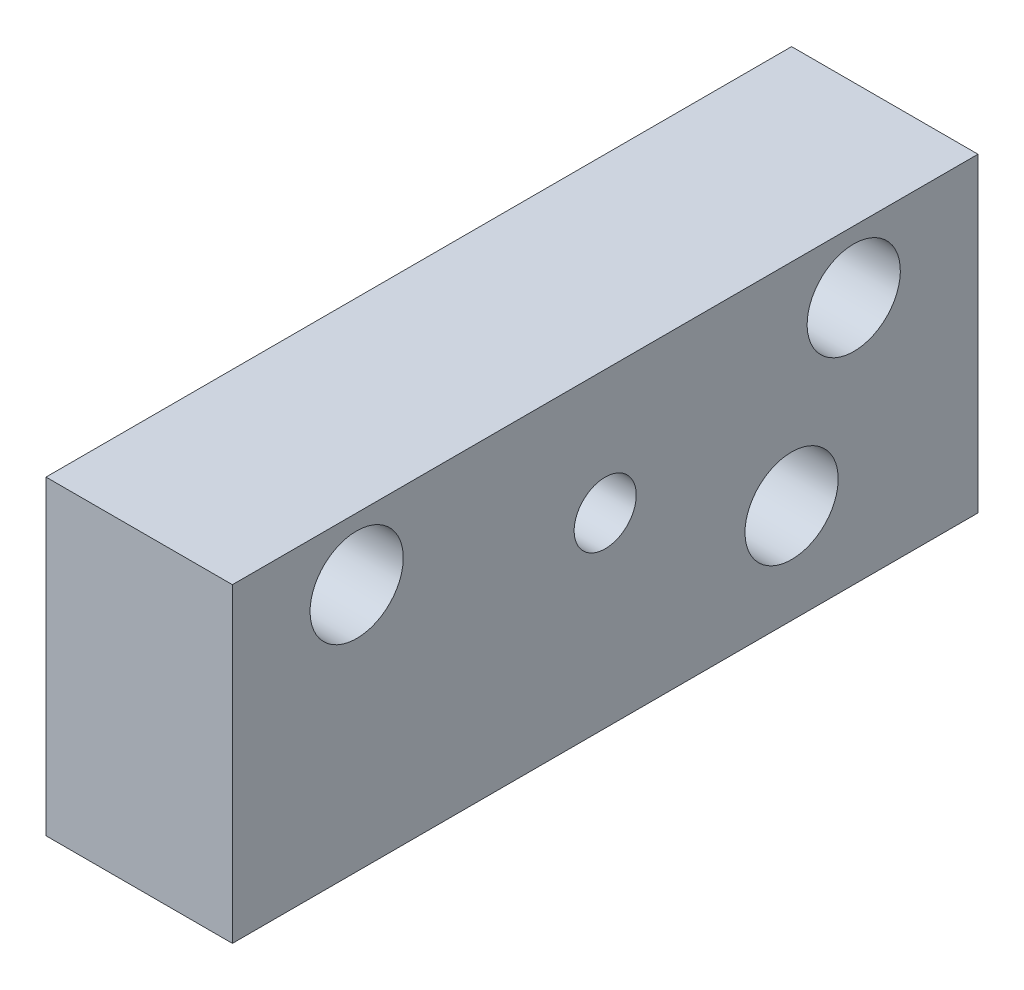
ISO-10303-21;
HEADER;
FILE_DESCRIPTION(('STEP AP214'),'2;1');
FILE_NAME('part.step','',(''),(''),'','','');
FILE_SCHEMA(('AUTOMOTIVE_DESIGN { 1 0 10303 214 1 1 1 1 }'));
ENDSEC;
DATA;
#1=APPLICATION_CONTEXT('core data for automotive mechanical design processes');
#2=APPLICATION_PROTOCOL_DEFINITION('international standard','automotive_design',2000,#1);
#3=PRODUCT_CONTEXT('',#1,'mechanical');
#4=PRODUCT('Part','Part','',(#3));
#5=PRODUCT_RELATED_PRODUCT_CATEGORY('part','',(#4));
#6=PRODUCT_DEFINITION_FORMATION('','',#4);
#7=PRODUCT_DEFINITION_CONTEXT('part definition',#1,'design');
#8=PRODUCT_DEFINITION('design','',#6,#7);
#9=PRODUCT_DEFINITION_SHAPE('','',#8);
#10=(LENGTH_UNIT() NAMED_UNIT(*) SI_UNIT(.MILLI.,.METRE.));
#11=(NAMED_UNIT(*) PLANE_ANGLE_UNIT() SI_UNIT($,.RADIAN.));
#12=(NAMED_UNIT(*) SI_UNIT($,.STERADIAN.) SOLID_ANGLE_UNIT());
#13=UNCERTAINTY_MEASURE_WITH_UNIT(LENGTH_MEASURE(1.E-05),#10,'distance_accuracy_value','');
#14=(GEOMETRIC_REPRESENTATION_CONTEXT(3) GLOBAL_UNCERTAINTY_ASSIGNED_CONTEXT((#13)) GLOBAL_UNIT_ASSIGNED_CONTEXT((#10,
#11,#12)) REPRESENTATION_CONTEXT('',''));
#15=CARTESIAN_POINT('',(0.,0.,0.));
#16=DIRECTION('',(0.,0.,1.));
#17=DIRECTION('',(1.,0.,0.));
#18=AXIS2_PLACEMENT_3D('',#15,#16,#17);
#19=CARTESIAN_POINT('',(47.625,0.,76.2));
#20=DIRECTION('',(0.,1.,0.));
#21=DIRECTION('',(-1.,0.,0.));
#22=AXIS2_PLACEMENT_3D('',#19,#20,#21);
#23=PLANE('',#22);
#24=DIRECTION('',(1.,0.,0.));
#25=VECTOR('',#24,1.);
#26=CARTESIAN_POINT('',(47.625,0.,0.));
#27=LINE('',#26,#25);
#28=CARTESIAN_POINT('',(28.575,0.,0.));
#29=VERTEX_POINT('',#28);
#30=CARTESIAN_POINT('',(47.625,0.,0.));
#31=VERTEX_POINT('',#30);
#32=EDGE_CURVE('E105',#29,#31,#27,.T.);
#33=ORIENTED_EDGE('',*,*,#32,.T.);
#34=DIRECTION('',(0.,0.,-1.));
#35=VECTOR('',#34,1.);
#36=CARTESIAN_POINT('',(47.625,0.,76.2));
#37=LINE('',#36,#35);
#38=CARTESIAN_POINT('',(47.625,0.,76.2));
#39=VERTEX_POINT('',#38);
#40=EDGE_CURVE('E50',#39,#31,#37,.T.);
#41=ORIENTED_EDGE('',*,*,#40,.F.);
#42=DIRECTION('',(1.,0.,0.));
#43=VECTOR('',#42,1.);
#44=CARTESIAN_POINT('',(47.625,0.,76.2));
#45=LINE('',#44,#43);
#46=CARTESIAN_POINT('',(28.575,0.,76.2));
#47=VERTEX_POINT('',#46);
#48=EDGE_CURVE('E97',#47,#39,#45,.T.);
#49=ORIENTED_EDGE('',*,*,#48,.F.);
#50=DIRECTION('',(0.,0.,-1.));
#51=VECTOR('',#50,1.);
#52=CARTESIAN_POINT('',(28.575,0.,76.2));
#53=LINE('',#52,#51);
#54=EDGE_CURVE('E11',#47,#29,#53,.T.);
#55=ORIENTED_EDGE('',*,*,#54,.T.);
#56=EDGE_LOOP('',(#33,#41,#49,#55));
#57=FACE_BOUND('',#56,.T.);
#58=ADVANCED_FACE('F41',(#57),#23,.F.);
#59=CARTESIAN_POINT('',(47.625,31.75,76.2));
#60=DIRECTION('',(-1.,0.,0.));
#61=DIRECTION('',(0.,-1.,0.));
#62=AXIS2_PLACEMENT_3D('',#59,#60,#61);
#63=PLANE('',#62);
#64=CARTESIAN_POINT('',(47.625,10.16,19.05));
#65=DIRECTION('',(1.,0.,0.));
#66=DIRECTION('',(0.,1.,0.));
#67=AXIS2_PLACEMENT_3D('',#64,#65,#66);
#68=CIRCLE('',#67,4.7625);
#69=CARTESIAN_POINT('',(47.625,14.9225,19.05));
#70=VERTEX_POINT('',#69);
#71=EDGE_CURVE('E161',#70,#70,#68,.T.);
#72=ORIENTED_EDGE('',*,*,#71,.F.);
#73=EDGE_LOOP('',(#72));
#74=FACE_BOUND('',#73,.T.);
#75=CARTESIAN_POINT('',(47.625,25.4,12.7));
#76=DIRECTION('',(1.,0.,0.));
#77=DIRECTION('',(0.,1.,0.));
#78=AXIS2_PLACEMENT_3D('',#75,#76,#77);
#79=CIRCLE('',#78,4.7625);
#80=CARTESIAN_POINT('',(47.625,30.1625,12.7));
#81=VERTEX_POINT('',#80);
#82=EDGE_CURVE('E165',#81,#81,#79,.T.);
#83=ORIENTED_EDGE('',*,*,#82,.F.);
#84=EDGE_LOOP('',(#83));
#85=FACE_BOUND('',#84,.T.);
#86=CARTESIAN_POINT('',(47.625,25.4,63.5));
#87=DIRECTION('',(1.,0.,0.));
#88=DIRECTION('',(0.,1.,0.));
#89=AXIS2_PLACEMENT_3D('',#86,#87,#88);
#90=CIRCLE('',#89,4.7625);
#91=CARTESIAN_POINT('',(47.625,30.1625,63.5));
#92=VERTEX_POINT('',#91);
#93=EDGE_CURVE('E169',#92,#92,#90,.T.);
#94=ORIENTED_EDGE('',*,*,#93,.F.);
#95=EDGE_LOOP('',(#94));
#96=FACE_BOUND('',#95,.T.);
#97=CARTESIAN_POINT('',(47.625,19.05,38.1));
#98=DIRECTION('',(1.,0.,0.));
#99=DIRECTION('',(0.,1.,0.));
#100=AXIS2_PLACEMENT_3D('',#97,#98,#99);
#101=CIRCLE('',#100,3.175);
#102=CARTESIAN_POINT('',(47.625,22.225,38.1));
#103=VERTEX_POINT('',#102);
#104=EDGE_CURVE('E172',#103,#103,#101,.T.);
#105=ORIENTED_EDGE('',*,*,#104,.F.);
#106=EDGE_LOOP('',(#105));
#107=FACE_BOUND('',#106,.T.);
#108=DIRECTION('',(0.,1.,0.));
#109=VECTOR('',#108,1.);
#110=CARTESIAN_POINT('',(47.625,31.75,0.));
#111=LINE('',#110,#109);
#112=CARTESIAN_POINT('',(47.625,31.75,0.));
#113=VERTEX_POINT('',#112);
#114=EDGE_CURVE('E83',#31,#113,#111,.T.);
#115=ORIENTED_EDGE('',*,*,#114,.T.);
#116=DIRECTION('',(0.,0.,-1.));
#117=VECTOR('',#116,1.);
#118=CARTESIAN_POINT('',(47.625,31.75,76.2));
#119=LINE('',#118,#117);
#120=CARTESIAN_POINT('',(47.625,31.75,76.2));
#121=VERTEX_POINT('',#120);
#122=EDGE_CURVE('E107',#121,#113,#119,.T.);
#123=ORIENTED_EDGE('',*,*,#122,.F.);
#124=DIRECTION('',(0.,1.,0.));
#125=VECTOR('',#124,1.);
#126=CARTESIAN_POINT('',(47.625,31.75,76.2));
#127=LINE('',#126,#125);
#128=EDGE_CURVE('E101',#39,#121,#127,.T.);
#129=ORIENTED_EDGE('',*,*,#128,.F.);
#130=ORIENTED_EDGE('',*,*,#40,.T.);
#131=EDGE_LOOP('',(#115,#123,#129,#130));
#132=FACE_BOUND('',#131,.T.);
#133=ADVANCED_FACE('F108',(#74,#85,#96,#107,#132),#63,.F.);
#134=CARTESIAN_POINT('',(28.575,31.75,76.2));
#135=DIRECTION('',(0.,-1.,0.));
#136=DIRECTION('',(0.,0.,-1.));
#137=AXIS2_PLACEMENT_3D('',#134,#135,#136);
#138=PLANE('',#137);
#139=DIRECTION('',(-1.,0.,0.));
#140=VECTOR('',#139,1.);
#141=CARTESIAN_POINT('',(28.575,31.75,0.));
#142=LINE('',#141,#140);
#143=CARTESIAN_POINT('',(28.575,31.75,0.));
#144=VERTEX_POINT('',#143);
#145=EDGE_CURVE('E91',#113,#144,#142,.T.);
#146=ORIENTED_EDGE('',*,*,#145,.T.);
#147=DIRECTION('',(0.,0.,-1.));
#148=VECTOR('',#147,1.);
#149=CARTESIAN_POINT('',(28.575,31.75,76.2));
#150=LINE('',#149,#148);
#151=CARTESIAN_POINT('',(28.575,31.75,76.2));
#152=VERTEX_POINT('',#151);
#153=EDGE_CURVE('E116',#152,#144,#150,.T.);
#154=ORIENTED_EDGE('',*,*,#153,.F.);
#155=DIRECTION('',(-1.,0.,0.));
#156=VECTOR('',#155,1.);
#157=CARTESIAN_POINT('',(28.575,31.75,76.2));
#158=LINE('',#157,#156);
#159=EDGE_CURVE('E111',#121,#152,#158,.T.);
#160=ORIENTED_EDGE('',*,*,#159,.F.);
#161=ORIENTED_EDGE('',*,*,#122,.T.);
#162=EDGE_LOOP('',(#146,#154,#160,#161));
#163=FACE_BOUND('',#162,.T.);
#164=ADVANCED_FACE('F134',(#163),#138,.F.);
#165=CARTESIAN_POINT('',(28.575,3.175,76.2));
#166=DIRECTION('',(1.,0.,0.));
#167=DIRECTION('',(0.,0.,-1.));
#168=AXIS2_PLACEMENT_3D('',#165,#166,#167);
#169=PLANE('',#168);
#170=CARTESIAN_POINT('',(28.575,10.16,19.05));
#171=DIRECTION('',(1.,0.,0.));
#172=DIRECTION('',(0.,0.,-1.));
#173=AXIS2_PLACEMENT_3D('',#170,#171,#172);
#174=CIRCLE('',#173,4.7625);
#175=CARTESIAN_POINT('',(28.575,10.16,14.2875));
#176=VERTEX_POINT('',#175);
#177=EDGE_CURVE('E189',#176,#176,#174,.F.);
#178=ORIENTED_EDGE('',*,*,#177,.F.);
#179=EDGE_LOOP('',(#178));
#180=FACE_BOUND('',#179,.T.);
#181=CARTESIAN_POINT('',(28.575,25.4,12.7));
#182=DIRECTION('',(1.,0.,0.));
#183=DIRECTION('',(0.,0.,-1.));
#184=AXIS2_PLACEMENT_3D('',#181,#182,#183);
#185=CIRCLE('',#184,4.7625);
#186=CARTESIAN_POINT('',(28.575,25.4,7.9375));
#187=VERTEX_POINT('',#186);
#188=EDGE_CURVE('E185',#187,#187,#185,.F.);
#189=ORIENTED_EDGE('',*,*,#188,.F.);
#190=EDGE_LOOP('',(#189));
#191=FACE_BOUND('',#190,.T.);
#192=CARTESIAN_POINT('',(28.575,25.4,63.5));
#193=DIRECTION('',(1.,0.,0.));
#194=DIRECTION('',(0.,0.,-1.));
#195=AXIS2_PLACEMENT_3D('',#192,#193,#194);
#196=CIRCLE('',#195,4.7625);
#197=CARTESIAN_POINT('',(28.575,25.4,58.7375));
#198=VERTEX_POINT('',#197);
#199=EDGE_CURVE('E174',#198,#198,#196,.F.);
#200=ORIENTED_EDGE('',*,*,#199,.F.);
#201=EDGE_LOOP('',(#200));
#202=FACE_BOUND('',#201,.T.);
#203=CARTESIAN_POINT('',(28.575,19.05,38.1));
#204=DIRECTION('',(1.,0.,0.));
#205=DIRECTION('',(0.,0.,-1.));
#206=AXIS2_PLACEMENT_3D('',#203,#204,#205);
#207=CIRCLE('',#206,3.175);
#208=CARTESIAN_POINT('',(28.575,19.05,34.925));
#209=VERTEX_POINT('',#208);
#210=EDGE_CURVE('E122',#209,#209,#207,.F.);
#211=ORIENTED_EDGE('',*,*,#210,.F.);
#212=EDGE_LOOP('',(#211));
#213=FACE_BOUND('',#212,.T.);
#214=DIRECTION('',(0.,-1.,0.));
#215=VECTOR('',#214,1.);
#216=CARTESIAN_POINT('',(28.575,3.175,0.));
#217=LINE('',#216,#215);
#218=EDGE_CURVE('E126',#144,#29,#217,.T.);
#219=ORIENTED_EDGE('',*,*,#218,.T.);
#220=ORIENTED_EDGE('',*,*,#54,.F.);
#221=DIRECTION('',(0.,-1.,0.));
#222=VECTOR('',#221,1.);
#223=CARTESIAN_POINT('',(28.575,3.175,76.2));
#224=LINE('',#223,#222);
#225=EDGE_CURVE('E61',#152,#47,#224,.T.);
#226=ORIENTED_EDGE('',*,*,#225,.F.);
#227=ORIENTED_EDGE('',*,*,#153,.T.);
#228=EDGE_LOOP('',(#219,#220,#226,#227));
#229=FACE_BOUND('',#228,.T.);
#230=ADVANCED_FACE('F138',(#180,#191,#202,#213,#229),#169,.F.);
#231=CARTESIAN_POINT('',(0.,0.,76.2));
#232=DIRECTION('',(0.,0.,-1.));
#233=DIRECTION('',(-1.,0.,0.));
#234=AXIS2_PLACEMENT_3D('',#231,#232,#233);
#235=PLANE('',#234);
#236=ORIENTED_EDGE('',*,*,#225,.T.);
#237=ORIENTED_EDGE('',*,*,#48,.T.);
#238=ORIENTED_EDGE('',*,*,#128,.T.);
#239=ORIENTED_EDGE('',*,*,#159,.T.);
#240=EDGE_LOOP('',(#236,#237,#238,#239));
#241=FACE_BOUND('',#240,.T.);
#242=ADVANCED_FACE('F99',(#241),#235,.F.);
#243=CARTESIAN_POINT('',(0.,0.,0.));
#244=DIRECTION('',(0.,0.,-1.));
#245=DIRECTION('',(-1.,0.,0.));
#246=AXIS2_PLACEMENT_3D('',#243,#244,#245);
#247=PLANE('',#246);
#248=ORIENTED_EDGE('',*,*,#32,.F.);
#249=ORIENTED_EDGE('',*,*,#218,.F.);
#250=ORIENTED_EDGE('',*,*,#145,.F.);
#251=ORIENTED_EDGE('',*,*,#114,.F.);
#252=EDGE_LOOP('',(#248,#249,#250,#251));
#253=FACE_BOUND('',#252,.T.);
#254=ADVANCED_FACE('F137',(#253),#247,.T.);
#255=CARTESIAN_POINT('',(28.574,19.05,38.1));
#256=DIRECTION('',(1.,0.,0.));
#257=DIRECTION('',(0.,1.,0.));
#258=AXIS2_PLACEMENT_3D('',#255,#256,#257);
#259=CYLINDRICAL_SURFACE('',#258,3.175);
#260=ORIENTED_EDGE('',*,*,#104,.T.);
#261=EDGE_LOOP('',(#260));
#262=FACE_BOUND('',#261,.T.);
#263=ORIENTED_EDGE('',*,*,#210,.T.);
#264=EDGE_LOOP('',(#263));
#265=FACE_BOUND('',#264,.T.);
#266=ADVANCED_FACE('F201',(#262,#265),#259,.F.);
#267=CARTESIAN_POINT('',(28.574,25.4,63.5));
#268=DIRECTION('',(1.,0.,0.));
#269=DIRECTION('',(0.,1.,0.));
#270=AXIS2_PLACEMENT_3D('',#267,#268,#269);
#271=CYLINDRICAL_SURFACE('',#270,4.7625);
#272=ORIENTED_EDGE('',*,*,#93,.T.);
#273=EDGE_LOOP('',(#272));
#274=FACE_BOUND('',#273,.T.);
#275=ORIENTED_EDGE('',*,*,#199,.T.);
#276=EDGE_LOOP('',(#275));
#277=FACE_BOUND('',#276,.T.);
#278=ADVANCED_FACE('F197',(#274,#277),#271,.F.);
#279=CARTESIAN_POINT('',(28.574,25.4,12.7));
#280=DIRECTION('',(1.,0.,0.));
#281=DIRECTION('',(0.,1.,0.));
#282=AXIS2_PLACEMENT_3D('',#279,#280,#281);
#283=CYLINDRICAL_SURFACE('',#282,4.7625);
#284=ORIENTED_EDGE('',*,*,#82,.T.);
#285=EDGE_LOOP('',(#284));
#286=FACE_BOUND('',#285,.T.);
#287=ORIENTED_EDGE('',*,*,#188,.T.);
#288=EDGE_LOOP('',(#287));
#289=FACE_BOUND('',#288,.T.);
#290=ADVANCED_FACE('F200',(#286,#289),#283,.F.);
#291=CARTESIAN_POINT('',(28.574,10.16,19.05));
#292=DIRECTION('',(1.,0.,0.));
#293=DIRECTION('',(0.,1.,0.));
#294=AXIS2_PLACEMENT_3D('',#291,#292,#293);
#295=CYLINDRICAL_SURFACE('',#294,4.7625);
#296=ORIENTED_EDGE('',*,*,#71,.T.);
#297=EDGE_LOOP('',(#296));
#298=FACE_BOUND('',#297,.T.);
#299=ORIENTED_EDGE('',*,*,#177,.T.);
#300=EDGE_LOOP('',(#299));
#301=FACE_BOUND('',#300,.T.);
#302=ADVANCED_FACE('F216',(#298,#301),#295,.F.);
#303=CLOSED_SHELL('',(#58,#133,#164,#230,#242,#254,#266,#278,#290,#302));
#304=MANIFOLD_SOLID_BREP('B2',#303);
#305=ADVANCED_BREP_SHAPE_REPRESENTATION('',(#18,#304),#14);
#306=SHAPE_DEFINITION_REPRESENTATION(#9,#305);
ENDSEC;
END-ISO-10303-21;
